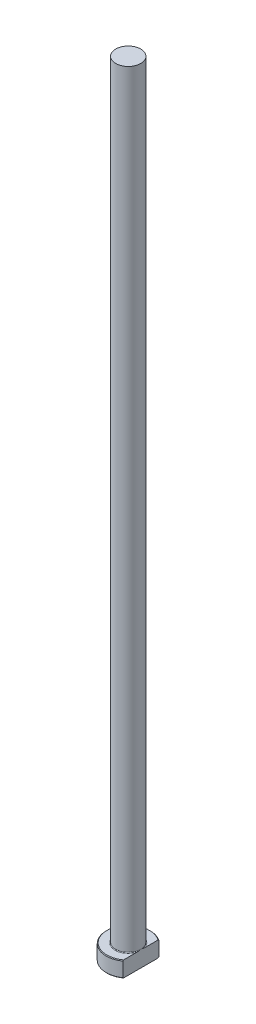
from build123d import *
from build123d.topology import SkipClean

# Parameters (mm, degrees)
CHAMFER1_SIZE = 0.2
FILLET1_R     = 0.2
KEY_DEPTH     = 251.195923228


with BuildPart() as part:
    # Sketch1 → Revolve1 (revolve)
    with BuildSketch(Plane.XY, mode=Mode.PRIVATE) as revolve1_sk:
        Polygon((0, 0), (-7, 0), (-7, 5), (-4, 5), (-4, 250), (0, 250), align=None)
    revolve(revolve1_sk.sketch.rotate(Axis((0, 259.958771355, 0), (0, -1, 0)), 270), axis=Axis((0, 259.958771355, 0), (0, -1, 0)))

    # Chamfer1
    chamfer1_edges = [part.edges().sort_by_distance(p)[0] for p in [
        (0, 5, -7),
        (0, 0, -7),
    ]]
    chamfer(chamfer1_edges, length=CHAMFER1_SIZE)

    # Fillet1
    fillet1_edges = [part.edges().sort_by_distance(p)[0] for p in [
        (0, 5, -4),
    ]]
    fillet(fillet1_edges, radius=FILLET1_R)

    # Sketch2 → KEY (cut, through all)
    with SkipClean():  # the faces are left unmerged after this step: merging them gives an invalid solid
        with BuildSketch(Plane(origin=(0, 0, 0), x_dir=(1, 0, 0), z_dir=(0, 1, 0))):
            with BuildLine():
                Line((4, 5.744562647), (4, -5.744562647))
                ThreePointArc((4, -5.744562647), (7, 0), (4, 5.744562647))
            make_face()
        extrude(amount=KEY_DEPTH, mode=Mode.SUBTRACT)


solid = part.part
